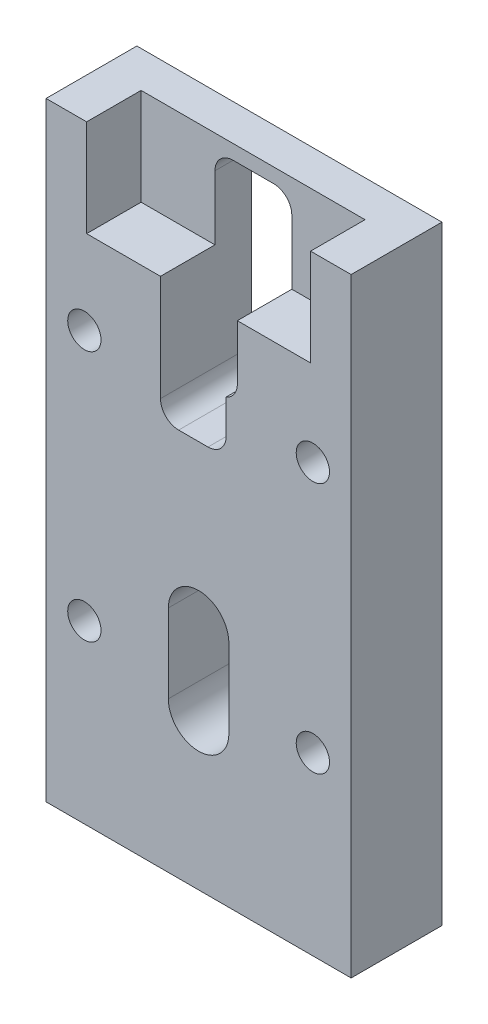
ISO-10303-21;
HEADER;
FILE_DESCRIPTION(('STEP AP214'),'2;1');
FILE_NAME('part.step','',(''),(''),'','','');
FILE_SCHEMA(('AUTOMOTIVE_DESIGN { 1 0 10303 214 1 1 1 1 }'));
ENDSEC;
DATA;
#1=APPLICATION_CONTEXT('core data for automotive mechanical design processes');
#2=APPLICATION_PROTOCOL_DEFINITION('international standard','automotive_design',2000,#1);
#3=PRODUCT_CONTEXT('',#1,'mechanical');
#4=PRODUCT('Part','Part','',(#3));
#5=PRODUCT_RELATED_PRODUCT_CATEGORY('part','',(#4));
#6=PRODUCT_DEFINITION_FORMATION('','',#4);
#7=PRODUCT_DEFINITION_CONTEXT('part definition',#1,'design');
#8=PRODUCT_DEFINITION('design','',#6,#7);
#9=PRODUCT_DEFINITION_SHAPE('','',#8);
#10=(LENGTH_UNIT() NAMED_UNIT(*) SI_UNIT(.MILLI.,.METRE.));
#11=(NAMED_UNIT(*) PLANE_ANGLE_UNIT() SI_UNIT($,.RADIAN.));
#12=(NAMED_UNIT(*) SI_UNIT($,.STERADIAN.) SOLID_ANGLE_UNIT());
#13=UNCERTAINTY_MEASURE_WITH_UNIT(LENGTH_MEASURE(1.E-05),#10,'distance_accuracy_value','');
#14=(GEOMETRIC_REPRESENTATION_CONTEXT(3) GLOBAL_UNCERTAINTY_ASSIGNED_CONTEXT((#13)) GLOBAL_UNIT_ASSIGNED_CONTEXT((#10,
#11,#12)) REPRESENTATION_CONTEXT('',''));
#15=CARTESIAN_POINT('',(0.,0.,0.));
#16=DIRECTION('',(0.,0.,1.));
#17=DIRECTION('',(1.,0.,0.));
#18=AXIS2_PLACEMENT_3D('',#15,#16,#17);
#19=CARTESIAN_POINT('',(18.5,34.325,-40.3112887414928));
#20=DIRECTION('',(0.,-1.,0.));
#21=DIRECTION('',(1.,0.,0.));
#22=AXIS2_PLACEMENT_3D('',#19,#20,#21);
#23=PLANE('',#22);
#24=DIRECTION('',(1.,0.,0.));
#25=VECTOR('',#24,1.);
#26=CARTESIAN_POINT('',(18.5,34.325,6.));
#27=LINE('',#26,#25);
#28=CARTESIAN_POINT('',(6.39999999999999,34.325,6.));
#29=VERTEX_POINT('',#28);
#30=CARTESIAN_POINT('',(18.5,34.325,6.));
#31=VERTEX_POINT('',#30);
#32=EDGE_CURVE('E296',#29,#31,#27,.T.);
#33=ORIENTED_EDGE('',*,*,#32,.F.);
#34=DIRECTION('',(0.,0.,1.));
#35=VECTOR('',#34,1.);
#36=CARTESIAN_POINT('',(6.39999999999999,34.325,-40.3112887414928));
#37=LINE('',#36,#35);
#38=CARTESIAN_POINT('',(6.39999999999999,34.325,15.));
#39=VERTEX_POINT('',#38);
#40=EDGE_CURVE('E342',#29,#39,#37,.T.);
#41=ORIENTED_EDGE('',*,*,#40,.T.);
#42=DIRECTION('',(1.,0.,0.));
#43=VECTOR('',#42,1.);
#44=CARTESIAN_POINT('',(18.5,34.325,15.));
#45=LINE('',#44,#43);
#46=CARTESIAN_POINT('',(18.5,34.325,15.));
#47=VERTEX_POINT('',#46);
#48=EDGE_CURVE('E281',#39,#47,#45,.T.);
#49=ORIENTED_EDGE('',*,*,#48,.T.);
#50=DIRECTION('',(0.,0.,1.));
#51=VECTOR('',#50,1.);
#52=CARTESIAN_POINT('',(18.5,34.325,-40.3112887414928));
#53=LINE('',#52,#51);
#54=EDGE_CURVE('E292',#31,#47,#53,.T.);
#55=ORIENTED_EDGE('',*,*,#54,.F.);
#56=EDGE_LOOP('',(#33,#41,#49,#55));
#57=FACE_BOUND('',#56,.T.);
#58=ADVANCED_FACE('F34',(#57),#23,.F.);
#59=CARTESIAN_POINT('',(25.2,-50.325,15.));
#60=DIRECTION('',(-1.,0.,0.));
#61=DIRECTION('',(0.,0.,1.));
#62=AXIS2_PLACEMENT_3D('',#59,#60,#61);
#63=PLANE('',#62);
#64=DIRECTION('',(0.,1.,0.));
#65=VECTOR('',#64,1.);
#66=CARTESIAN_POINT('',(25.2,-50.325,0.));
#67=LINE('',#66,#65);
#68=CARTESIAN_POINT('',(25.2,-50.325,0.));
#69=VERTEX_POINT('',#68);
#70=CARTESIAN_POINT('',(25.2,50.325,0.));
#71=VERTEX_POINT('',#70);
#72=EDGE_CURVE('E307',#69,#71,#67,.T.);
#73=ORIENTED_EDGE('',*,*,#72,.T.);
#74=DIRECTION('',(0.,0.,-1.));
#75=VECTOR('',#74,1.);
#76=CARTESIAN_POINT('',(25.2,50.325,15.));
#77=LINE('',#76,#75);
#78=CARTESIAN_POINT('',(25.2,50.325,15.));
#79=VERTEX_POINT('',#78);
#80=EDGE_CURVE('E336',#79,#71,#77,.T.);
#81=ORIENTED_EDGE('',*,*,#80,.F.);
#82=DIRECTION('',(0.,1.,0.));
#83=VECTOR('',#82,1.);
#84=CARTESIAN_POINT('',(25.2,-50.325,15.));
#85=LINE('',#84,#83);
#86=CARTESIAN_POINT('',(25.2,-50.325,15.));
#87=VERTEX_POINT('',#86);
#88=EDGE_CURVE('E308',#87,#79,#85,.T.);
#89=ORIENTED_EDGE('',*,*,#88,.F.);
#90=DIRECTION('',(0.,0.,-1.));
#91=VECTOR('',#90,1.);
#92=CARTESIAN_POINT('',(25.2,-50.325,15.));
#93=LINE('',#92,#91);
#94=EDGE_CURVE('E320',#87,#69,#93,.T.);
#95=ORIENTED_EDGE('',*,*,#94,.T.);
#96=EDGE_LOOP('',(#73,#81,#89,#95));
#97=FACE_BOUND('',#96,.T.);
#98=ADVANCED_FACE('F449',(#97),#63,.F.);
#99=CARTESIAN_POINT('',(-25.2,50.325,15.));
#100=DIRECTION('',(0.,-1.,0.));
#101=DIRECTION('',(0.,0.,-1.));
#102=AXIS2_PLACEMENT_3D('',#99,#100,#101);
#103=PLANE('',#102);
#104=DIRECTION('',(-1.,0.,0.));
#105=VECTOR('',#104,1.);
#106=CARTESIAN_POINT('',(-25.2,50.325,15.));
#107=LINE('',#106,#105);
#108=CARTESIAN_POINT('',(-18.5,50.325,15.));
#109=VERTEX_POINT('',#108);
#110=CARTESIAN_POINT('',(-25.2,50.325,15.));
#111=VERTEX_POINT('',#110);
#112=EDGE_CURVE('E311',#109,#111,#107,.T.);
#113=ORIENTED_EDGE('',*,*,#112,.F.);
#114=DIRECTION('',(0.,0.,1.));
#115=VECTOR('',#114,1.);
#116=CARTESIAN_POINT('',(-18.5,50.325,-40.3112887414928));
#117=LINE('',#116,#115);
#118=CARTESIAN_POINT('',(-18.5,50.325,5.99999999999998));
#119=VERTEX_POINT('',#118);
#120=EDGE_CURVE('E288',#119,#109,#117,.T.);
#121=ORIENTED_EDGE('',*,*,#120,.F.);
#122=DIRECTION('',(-1.,0.,0.));
#123=VECTOR('',#122,1.);
#124=CARTESIAN_POINT('',(18.5,50.325,6.));
#125=LINE('',#124,#123);
#126=CARTESIAN_POINT('',(18.5,50.325,6.));
#127=VERTEX_POINT('',#126);
#128=EDGE_CURVE('E280',#127,#119,#125,.T.);
#129=ORIENTED_EDGE('',*,*,#128,.F.);
#130=DIRECTION('',(0.,0.,1.));
#131=VECTOR('',#130,1.);
#132=CARTESIAN_POINT('',(18.5,50.325,-40.3112887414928));
#133=LINE('',#132,#131);
#134=CARTESIAN_POINT('',(18.5,50.325,15.));
#135=VERTEX_POINT('',#134);
#136=EDGE_CURVE('E291',#127,#135,#133,.T.);
#137=ORIENTED_EDGE('',*,*,#136,.T.);
#138=EDGE_CURVE('E313',#79,#135,#107,.T.);
#139=ORIENTED_EDGE('',*,*,#138,.F.);
#140=ORIENTED_EDGE('',*,*,#80,.T.);
#141=DIRECTION('',(-1.,0.,0.));
#142=VECTOR('',#141,1.);
#143=CARTESIAN_POINT('',(-25.2,50.325,0.));
#144=LINE('',#143,#142);
#145=CARTESIAN_POINT('',(-25.2,50.325,0.));
#146=VERTEX_POINT('',#145);
#147=EDGE_CURVE('E323',#71,#146,#144,.T.);
#148=ORIENTED_EDGE('',*,*,#147,.T.);
#149=DIRECTION('',(0.,0.,-1.));
#150=VECTOR('',#149,1.);
#151=CARTESIAN_POINT('',(-25.2,50.325,15.));
#152=LINE('',#151,#150);
#153=EDGE_CURVE('E333',#111,#146,#152,.T.);
#154=ORIENTED_EDGE('',*,*,#153,.F.);
#155=EDGE_LOOP('',(#113,#121,#129,#137,#139,#140,#148,#154));
#156=FACE_BOUND('',#155,.T.);
#157=ADVANCED_FACE('F462',(#156),#103,.F.);
#158=CARTESIAN_POINT('',(-25.2,-50.325,15.));
#159=DIRECTION('',(1.,0.,0.));
#160=DIRECTION('',(0.,0.,-1.));
#161=AXIS2_PLACEMENT_3D('',#158,#159,#160);
#162=PLANE('',#161);
#163=DIRECTION('',(0.,-1.,0.));
#164=VECTOR('',#163,1.);
#165=CARTESIAN_POINT('',(-25.2,-50.325,0.));
#166=LINE('',#165,#164);
#167=CARTESIAN_POINT('',(-25.2,-50.325,0.));
#168=VERTEX_POINT('',#167);
#169=EDGE_CURVE('E325',#146,#168,#166,.T.);
#170=ORIENTED_EDGE('',*,*,#169,.T.);
#171=DIRECTION('',(0.,0.,-1.));
#172=VECTOR('',#171,1.);
#173=CARTESIAN_POINT('',(-25.2,-50.325,15.));
#174=LINE('',#173,#172);
#175=CARTESIAN_POINT('',(-25.2,-50.325,15.));
#176=VERTEX_POINT('',#175);
#177=EDGE_CURVE('E330',#176,#168,#174,.T.);
#178=ORIENTED_EDGE('',*,*,#177,.F.);
#179=DIRECTION('',(0.,-1.,0.));
#180=VECTOR('',#179,1.);
#181=CARTESIAN_POINT('',(-25.2,-50.325,15.));
#182=LINE('',#181,#180);
#183=EDGE_CURVE('E316',#111,#176,#182,.T.);
#184=ORIENTED_EDGE('',*,*,#183,.F.);
#185=ORIENTED_EDGE('',*,*,#153,.T.);
#186=EDGE_LOOP('',(#170,#178,#184,#185));
#187=FACE_BOUND('',#186,.T.);
#188=ADVANCED_FACE('F458',(#187),#162,.F.);
#189=CARTESIAN_POINT('',(-25.2,-50.325,15.));
#190=DIRECTION('',(0.,1.,0.));
#191=DIRECTION('',(0.,0.,1.));
#192=AXIS2_PLACEMENT_3D('',#189,#190,#191);
#193=PLANE('',#192);
#194=DIRECTION('',(1.,0.,0.));
#195=VECTOR('',#194,1.);
#196=CARTESIAN_POINT('',(-25.2,-50.325,0.));
#197=LINE('',#196,#195);
#198=EDGE_CURVE('E312',#168,#69,#197,.T.);
#199=ORIENTED_EDGE('',*,*,#198,.T.);
#200=ORIENTED_EDGE('',*,*,#94,.F.);
#201=DIRECTION('',(1.,0.,0.));
#202=VECTOR('',#201,1.);
#203=CARTESIAN_POINT('',(-25.2,-50.325,15.));
#204=LINE('',#203,#202);
#205=EDGE_CURVE('E318',#176,#87,#204,.T.);
#206=ORIENTED_EDGE('',*,*,#205,.F.);
#207=ORIENTED_EDGE('',*,*,#177,.T.);
#208=EDGE_LOOP('',(#199,#200,#206,#207));
#209=FACE_BOUND('',#208,.T.);
#210=ADVANCED_FACE('F454',(#209),#193,.F.);
#211=CARTESIAN_POINT('',(0.,0.,15.));
#212=DIRECTION('',(0.,0.,-1.));
#213=DIRECTION('',(-1.,0.,0.));
#214=AXIS2_PLACEMENT_3D('',#211,#212,#213);
#215=PLANE('',#214);
#216=CARTESIAN_POINT('',(18.875,-21.25,15.));
#217=DIRECTION('',(0.,0.,-1.));
#218=DIRECTION('',(-1.,0.,0.));
#219=AXIS2_PLACEMENT_3D('',#216,#217,#218);
#220=CIRCLE('',#219,2.75);
#221=CARTESIAN_POINT('',(16.125,-21.25,15.));
#222=VERTEX_POINT('',#221);
#223=EDGE_CURVE('E769',#222,#222,#220,.T.);
#224=ORIENTED_EDGE('',*,*,#223,.T.);
#225=EDGE_LOOP('',(#224));
#226=FACE_BOUND('',#225,.T.);
#227=CARTESIAN_POINT('',(-18.875,-21.25,15.));
#228=DIRECTION('',(0.,0.,-1.));
#229=DIRECTION('',(-1.,0.,0.));
#230=AXIS2_PLACEMENT_3D('',#227,#228,#229);
#231=CIRCLE('',#230,2.75);
#232=CARTESIAN_POINT('',(-21.625,-21.25,15.));
#233=VERTEX_POINT('',#232);
#234=EDGE_CURVE('E765',#233,#233,#231,.T.);
#235=ORIENTED_EDGE('',*,*,#234,.T.);
#236=EDGE_LOOP('',(#235));
#237=FACE_BOUND('',#236,.T.);
#238=CARTESIAN_POINT('',(-18.875,20.3,15.));
#239=DIRECTION('',(0.,0.,-1.));
#240=DIRECTION('',(-1.,0.,0.));
#241=AXIS2_PLACEMENT_3D('',#238,#239,#240);
#242=CIRCLE('',#241,2.75);
#243=CARTESIAN_POINT('',(-21.625,20.3,15.));
#244=VERTEX_POINT('',#243);
#245=EDGE_CURVE('E763',#244,#244,#242,.T.);
#246=ORIENTED_EDGE('',*,*,#245,.T.);
#247=EDGE_LOOP('',(#246));
#248=FACE_BOUND('',#247,.T.);
#249=CARTESIAN_POINT('',(18.875,20.3,15.));
#250=DIRECTION('',(0.,0.,-1.));
#251=DIRECTION('',(-1.,0.,0.));
#252=AXIS2_PLACEMENT_3D('',#249,#250,#251);
#253=CIRCLE('',#252,2.75);
#254=CARTESIAN_POINT('',(16.125,20.3,15.));
#255=VERTEX_POINT('',#254);
#256=EDGE_CURVE('E390',#255,#255,#253,.T.);
#257=ORIENTED_EDGE('',*,*,#256,.T.);
#258=EDGE_LOOP('',(#257));
#259=FACE_BOUND('',#258,.T.);
#260=DIRECTION('',(0.,-1.,0.));
#261=VECTOR('',#260,1.);
#262=CARTESIAN_POINT('',(5.,-25.475,15.));
#263=LINE('',#262,#261);
#264=CARTESIAN_POINT('',(5.,-12.475,15.));
#265=VERTEX_POINT('',#264);
#266=CARTESIAN_POINT('',(5.,-25.475,15.));
#267=VERTEX_POINT('',#266);
#268=EDGE_CURVE('E209',#265,#267,#263,.T.);
#269=ORIENTED_EDGE('',*,*,#268,.T.);
#270=CARTESIAN_POINT('',(0.,-25.475,15.));
#271=DIRECTION('',(0.,0.,-1.));
#272=DIRECTION('',(-1.,0.,0.));
#273=AXIS2_PLACEMENT_3D('',#270,#271,#272);
#274=CIRCLE('',#273,5.);
#275=CARTESIAN_POINT('',(-5.,-25.475,15.));
#276=VERTEX_POINT('',#275);
#277=EDGE_CURVE('E201',#267,#276,#274,.T.);
#278=ORIENTED_EDGE('',*,*,#277,.T.);
#279=DIRECTION('',(0.,1.,0.));
#280=VECTOR('',#279,1.);
#281=CARTESIAN_POINT('',(-5.,-25.475,15.));
#282=LINE('',#281,#280);
#283=CARTESIAN_POINT('',(-5.,-12.475,15.));
#284=VERTEX_POINT('',#283);
#285=EDGE_CURVE('E213',#276,#284,#282,.T.);
#286=ORIENTED_EDGE('',*,*,#285,.T.);
#287=CARTESIAN_POINT('',(0.,-12.475,15.));
#288=DIRECTION('',(0.,0.,-1.));
#289=DIRECTION('',(-1.,0.,0.));
#290=AXIS2_PLACEMENT_3D('',#287,#288,#289);
#291=CIRCLE('',#290,5.);
#292=EDGE_CURVE('E217',#284,#265,#291,.T.);
#293=ORIENTED_EDGE('',*,*,#292,.T.);
#294=EDGE_LOOP('',(#269,#278,#286,#293));
#295=FACE_BOUND('',#294,.T.);
#296=ORIENTED_EDGE('',*,*,#48,.F.);
#297=DIRECTION('',(0.,-1.,0.));
#298=VECTOR('',#297,1.);
#299=CARTESIAN_POINT('',(6.39999999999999,47.925,15.));
#300=LINE('',#299,#298);
#301=CARTESIAN_POINT('',(6.39999999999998,25.2458302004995,15.));
#302=VERTEX_POINT('',#301);
#303=EDGE_CURVE('E251',#39,#302,#300,.T.);
#304=ORIENTED_EDGE('',*,*,#303,.T.);
#305=CARTESIAN_POINT('',(3.39999999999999,25.2458302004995,15.));
#306=DIRECTION('',(0.,0.,-1.));
#307=DIRECTION('',(-1.,0.,0.));
#308=AXIS2_PLACEMENT_3D('',#305,#306,#307);
#309=CIRCLE('',#308,3.);
#310=CARTESIAN_POINT('',(4.54999999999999,22.475,15.));
#311=VERTEX_POINT('',#310);
#312=EDGE_CURVE('E383',#302,#311,#309,.T.);
#313=ORIENTED_EDGE('',*,*,#312,.T.);
#314=DIRECTION('',(0.,-1.,0.));
#315=VECTOR('',#314,1.);
#316=CARTESIAN_POINT('',(4.54999999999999,22.475,15.));
#317=LINE('',#316,#315);
#318=CARTESIAN_POINT('',(4.54999999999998,16.825,15.));
#319=VERTEX_POINT('',#318);
#320=EDGE_CURVE('E254',#311,#319,#317,.T.);
#321=ORIENTED_EDGE('',*,*,#320,.T.);
#322=CARTESIAN_POINT('',(1.54999999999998,16.825,15.));
#323=DIRECTION('',(0.,0.,-1.));
#324=DIRECTION('',(-1.,0.,0.));
#325=AXIS2_PLACEMENT_3D('',#322,#323,#324);
#326=CIRCLE('',#325,3.);
#327=CARTESIAN_POINT('',(1.54999999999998,13.825,15.));
#328=VERTEX_POINT('',#327);
#329=EDGE_CURVE('E12',#319,#328,#326,.T.);
#330=ORIENTED_EDGE('',*,*,#329,.T.);
#331=DIRECTION('',(-1.,0.,0.));
#332=VECTOR('',#331,1.);
#333=CARTESIAN_POINT('',(4.54999999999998,13.825,15.));
#334=LINE('',#333,#332);
#335=CARTESIAN_POINT('',(-3.30000000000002,13.825,15.));
#336=VERTEX_POINT('',#335);
#337=EDGE_CURVE('E245',#328,#336,#334,.T.);
#338=ORIENTED_EDGE('',*,*,#337,.T.);
#339=CARTESIAN_POINT('',(-3.30000000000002,16.825,15.));
#340=DIRECTION('',(0.,0.,-1.));
#341=DIRECTION('',(-1.,0.,0.));
#342=AXIS2_PLACEMENT_3D('',#339,#340,#341);
#343=CIRCLE('',#342,3.);
#344=CARTESIAN_POINT('',(-6.30000000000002,16.825,15.));
#345=VERTEX_POINT('',#344);
#346=EDGE_CURVE('E371',#336,#345,#343,.T.);
#347=ORIENTED_EDGE('',*,*,#346,.T.);
#348=DIRECTION('',(0.,1.,0.));
#349=VECTOR('',#348,1.);
#350=CARTESIAN_POINT('',(-6.30000000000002,13.825,15.));
#351=LINE('',#350,#349);
#352=CARTESIAN_POINT('',(-6.30000000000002,34.325,15.));
#353=VERTEX_POINT('',#352);
#354=EDGE_CURVE('E248',#345,#353,#351,.T.);
#355=ORIENTED_EDGE('',*,*,#354,.T.);
#356=CARTESIAN_POINT('',(-18.5,34.325,15.));
#357=VERTEX_POINT('',#356);
#358=EDGE_CURVE('E277',#357,#353,#45,.T.);
#359=ORIENTED_EDGE('',*,*,#358,.F.);
#360=DIRECTION('',(0.,-1.,0.));
#361=VECTOR('',#360,1.);
#362=CARTESIAN_POINT('',(-18.5,50.325,15.));
#363=LINE('',#362,#361);
#364=EDGE_CURVE('E282',#109,#357,#363,.T.);
#365=ORIENTED_EDGE('',*,*,#364,.F.);
#366=ORIENTED_EDGE('',*,*,#112,.T.);
#367=ORIENTED_EDGE('',*,*,#183,.T.);
#368=ORIENTED_EDGE('',*,*,#205,.T.);
#369=ORIENTED_EDGE('',*,*,#88,.T.);
#370=ORIENTED_EDGE('',*,*,#138,.T.);
#371=DIRECTION('',(0.,1.,0.));
#372=VECTOR('',#371,1.);
#373=CARTESIAN_POINT('',(18.5,50.325,15.));
#374=LINE('',#373,#372);
#375=EDGE_CURVE('E276',#47,#135,#374,.T.);
#376=ORIENTED_EDGE('',*,*,#375,.F.);
#377=EDGE_LOOP('',(#296,#304,#313,#321,#330,#338,#347,#355,#359,#365,#366,#367,#368,#369,#370,#376));
#378=FACE_BOUND('',#377,.T.);
#379=ADVANCED_FACE('F219',(#226,#237,#248,#259,#295,#378),#215,.F.);
#380=CARTESIAN_POINT('',(0.,0.,0.));
#381=DIRECTION('',(0.,0.,-1.));
#382=DIRECTION('',(-1.,0.,0.));
#383=AXIS2_PLACEMENT_3D('',#380,#381,#382);
#384=PLANE('',#383);
#385=CARTESIAN_POINT('',(18.875,20.3,0.));
#386=DIRECTION('',(0.,0.,-1.));
#387=DIRECTION('',(-1.,0.,0.));
#388=AXIS2_PLACEMENT_3D('',#385,#386,#387);
#389=CIRCLE('',#388,4.725);
#390=CARTESIAN_POINT('',(14.15,20.3,0.));
#391=VERTEX_POINT('',#390);
#392=EDGE_CURVE('E397',#391,#391,#389,.T.);
#393=ORIENTED_EDGE('',*,*,#392,.F.);
#394=EDGE_LOOP('',(#393));
#395=FACE_BOUND('',#394,.T.);
#396=CARTESIAN_POINT('',(18.875,-21.25,0.));
#397=DIRECTION('',(0.,0.,-1.));
#398=DIRECTION('',(-1.,0.,0.));
#399=AXIS2_PLACEMENT_3D('',#396,#397,#398);
#400=CIRCLE('',#399,4.725);
#401=CARTESIAN_POINT('',(14.15,-21.25,0.));
#402=VERTEX_POINT('',#401);
#403=EDGE_CURVE('E406',#402,#402,#400,.T.);
#404=ORIENTED_EDGE('',*,*,#403,.F.);
#405=EDGE_LOOP('',(#404));
#406=FACE_BOUND('',#405,.T.);
#407=CARTESIAN_POINT('',(-18.875,-21.25,0.));
#408=DIRECTION('',(0.,0.,-1.));
#409=DIRECTION('',(-1.,0.,0.));
#410=AXIS2_PLACEMENT_3D('',#407,#408,#409);
#411=CIRCLE('',#410,4.725);
#412=CARTESIAN_POINT('',(-23.6,-21.25,0.));
#413=VERTEX_POINT('',#412);
#414=EDGE_CURVE('E417',#413,#413,#411,.T.);
#415=ORIENTED_EDGE('',*,*,#414,.F.);
#416=EDGE_LOOP('',(#415));
#417=FACE_BOUND('',#416,.T.);
#418=CARTESIAN_POINT('',(-18.875,20.3,0.));
#419=DIRECTION('',(0.,0.,-1.));
#420=DIRECTION('',(-1.,0.,0.));
#421=AXIS2_PLACEMENT_3D('',#418,#419,#420);
#422=CIRCLE('',#421,4.725);
#423=CARTESIAN_POINT('',(-23.6,20.3,0.));
#424=VERTEX_POINT('',#423);
#425=EDGE_CURVE('E228',#424,#424,#422,.T.);
#426=ORIENTED_EDGE('',*,*,#425,.F.);
#427=EDGE_LOOP('',(#426));
#428=FACE_BOUND('',#427,.T.);
#429=CARTESIAN_POINT('',(0.,-25.475,0.));
#430=DIRECTION('',(0.,0.,-1.));
#431=DIRECTION('',(-1.,0.,0.));
#432=AXIS2_PLACEMENT_3D('',#429,#430,#431);
#433=CIRCLE('',#432,5.);
#434=CARTESIAN_POINT('',(5.,-25.475,0.));
#435=VERTEX_POINT('',#434);
#436=CARTESIAN_POINT('',(-5.,-25.475,0.));
#437=VERTEX_POINT('',#436);
#438=EDGE_CURVE('E204',#435,#437,#433,.T.);
#439=ORIENTED_EDGE('',*,*,#438,.F.);
#440=DIRECTION('',(0.,-1.,0.));
#441=VECTOR('',#440,1.);
#442=CARTESIAN_POINT('',(5.,-25.475,0.));
#443=LINE('',#442,#441);
#444=CARTESIAN_POINT('',(5.,-12.475,0.));
#445=VERTEX_POINT('',#444);
#446=EDGE_CURVE('E222',#445,#435,#443,.T.);
#447=ORIENTED_EDGE('',*,*,#446,.F.);
#448=CARTESIAN_POINT('',(0.,-12.475,0.));
#449=DIRECTION('',(0.,0.,-1.));
#450=DIRECTION('',(-1.,0.,0.));
#451=AXIS2_PLACEMENT_3D('',#448,#449,#450);
#452=CIRCLE('',#451,5.);
#453=CARTESIAN_POINT('',(-5.,-12.475,0.));
#454=VERTEX_POINT('',#453);
#455=EDGE_CURVE('E225',#454,#445,#452,.T.);
#456=ORIENTED_EDGE('',*,*,#455,.F.);
#457=DIRECTION('',(0.,1.,0.));
#458=VECTOR('',#457,1.);
#459=CARTESIAN_POINT('',(-5.,-25.475,0.));
#460=LINE('',#459,#458);
#461=EDGE_CURVE('E234',#437,#454,#460,.T.);
#462=ORIENTED_EDGE('',*,*,#461,.F.);
#463=EDGE_LOOP('',(#439,#447,#456,#462));
#464=FACE_BOUND('',#463,.T.);
#465=DIRECTION('',(-1.,0.,0.));
#466=VECTOR('',#465,1.);
#467=CARTESIAN_POINT('',(4.54999999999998,13.825,0.));
#468=LINE('',#467,#466);
#469=CARTESIAN_POINT('',(1.54999999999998,13.825,0.));
#470=VERTEX_POINT('',#469);
#471=CARTESIAN_POINT('',(-3.30000000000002,13.825,0.));
#472=VERTEX_POINT('',#471);
#473=EDGE_CURVE('E256',#470,#472,#468,.T.);
#474=ORIENTED_EDGE('',*,*,#473,.F.);
#475=CARTESIAN_POINT('',(1.54999999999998,16.825,0.));
#476=DIRECTION('',(0.,0.,-1.));
#477=DIRECTION('',(-1.,0.,0.));
#478=AXIS2_PLACEMENT_3D('',#475,#476,#477);
#479=CIRCLE('',#478,3.);
#480=CARTESIAN_POINT('',(4.54999999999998,16.825,0.));
#481=VERTEX_POINT('',#480);
#482=EDGE_CURVE('E43',#470,#481,#479,.F.);
#483=ORIENTED_EDGE('',*,*,#482,.T.);
#484=DIRECTION('',(0.,-1.,0.));
#485=VECTOR('',#484,1.);
#486=CARTESIAN_POINT('',(4.54999999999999,22.475,0.));
#487=LINE('',#486,#485);
#488=CARTESIAN_POINT('',(4.54999999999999,22.475,0.));
#489=VERTEX_POINT('',#488);
#490=EDGE_CURVE('E249',#489,#481,#487,.T.);
#491=ORIENTED_EDGE('',*,*,#490,.F.);
#492=CARTESIAN_POINT('',(3.39999999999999,25.2458302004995,0.));
#493=DIRECTION('',(0.,0.,-1.));
#494=DIRECTION('',(-1.,0.,0.));
#495=AXIS2_PLACEMENT_3D('',#492,#493,#494);
#496=CIRCLE('',#495,3.);
#497=CARTESIAN_POINT('',(6.39999999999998,25.2458302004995,0.));
#498=VERTEX_POINT('',#497);
#499=EDGE_CURVE('E381',#489,#498,#496,.F.);
#500=ORIENTED_EDGE('',*,*,#499,.T.);
#501=DIRECTION('',(0.,-1.,0.));
#502=VECTOR('',#501,1.);
#503=CARTESIAN_POINT('',(6.39999999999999,47.925,0.));
#504=LINE('',#503,#502);
#505=CARTESIAN_POINT('',(6.39999999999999,44.925,0.));
#506=VERTEX_POINT('',#505);
#507=EDGE_CURVE('E266',#506,#498,#504,.T.);
#508=ORIENTED_EDGE('',*,*,#507,.F.);
#509=CARTESIAN_POINT('',(3.39999999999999,44.925,0.));
#510=DIRECTION('',(0.,0.,-1.));
#511=DIRECTION('',(-1.,0.,0.));
#512=AXIS2_PLACEMENT_3D('',#509,#510,#511);
#513=CIRCLE('',#512,3.);
#514=CARTESIAN_POINT('',(3.39999999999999,47.925,0.));
#515=VERTEX_POINT('',#514);
#516=EDGE_CURVE('E377',#506,#515,#513,.F.);
#517=ORIENTED_EDGE('',*,*,#516,.T.);
#518=DIRECTION('',(1.,0.,0.));
#519=VECTOR('',#518,1.);
#520=CARTESIAN_POINT('',(-6.30000000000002,47.925,0.));
#521=LINE('',#520,#519);
#522=CARTESIAN_POINT('',(-3.30000000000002,47.925,0.));
#523=VERTEX_POINT('',#522);
#524=EDGE_CURVE('E263',#523,#515,#521,.T.);
#525=ORIENTED_EDGE('',*,*,#524,.F.);
#526=CARTESIAN_POINT('',(-3.30000000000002,44.925,0.));
#527=DIRECTION('',(0.,0.,-1.));
#528=DIRECTION('',(-1.,0.,0.));
#529=AXIS2_PLACEMENT_3D('',#526,#527,#528);
#530=CIRCLE('',#529,3.);
#531=CARTESIAN_POINT('',(-6.30000000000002,44.925,0.));
#532=VERTEX_POINT('',#531);
#533=EDGE_CURVE('E373',#523,#532,#530,.F.);
#534=ORIENTED_EDGE('',*,*,#533,.T.);
#535=DIRECTION('',(0.,1.,0.));
#536=VECTOR('',#535,1.);
#537=CARTESIAN_POINT('',(-6.30000000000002,13.825,0.));
#538=LINE('',#537,#536);
#539=CARTESIAN_POINT('',(-6.30000000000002,16.825,0.));
#540=VERTEX_POINT('',#539);
#541=EDGE_CURVE('E259',#540,#532,#538,.T.);
#542=ORIENTED_EDGE('',*,*,#541,.F.);
#543=CARTESIAN_POINT('',(-3.30000000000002,16.825,0.));
#544=DIRECTION('',(0.,0.,-1.));
#545=DIRECTION('',(-1.,0.,0.));
#546=AXIS2_PLACEMENT_3D('',#543,#544,#545);
#547=CIRCLE('',#546,3.);
#548=EDGE_CURVE('E369',#540,#472,#547,.F.);
#549=ORIENTED_EDGE('',*,*,#548,.T.);
#550=EDGE_LOOP('',(#474,#483,#491,#500,#508,#517,#525,#534,#542,#549));
#551=FACE_BOUND('',#550,.T.);
#552=ORIENTED_EDGE('',*,*,#72,.F.);
#553=ORIENTED_EDGE('',*,*,#198,.F.);
#554=ORIENTED_EDGE('',*,*,#169,.F.);
#555=ORIENTED_EDGE('',*,*,#147,.F.);
#556=EDGE_LOOP('',(#552,#553,#554,#555));
#557=FACE_BOUND('',#556,.T.);
#558=ADVANCED_FACE('F433',(#395,#406,#417,#428,#464,#551,#557),#384,.T.);
#559=CARTESIAN_POINT('',(0.,0.,6.));
#560=DIRECTION('',(0.,0.,-1.));
#561=DIRECTION('',(-1.,0.,0.));
#562=AXIS2_PLACEMENT_3D('',#559,#560,#561);
#563=PLANE('',#562);
#564=DIRECTION('',(0.,1.,0.));
#565=VECTOR('',#564,1.);
#566=CARTESIAN_POINT('',(-6.30000000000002,0.,6.));
#567=LINE('',#566,#565);
#568=CARTESIAN_POINT('',(-6.30000000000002,34.325,6.));
#569=VERTEX_POINT('',#568);
#570=CARTESIAN_POINT('',(-6.30000000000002,44.925,6.));
#571=VERTEX_POINT('',#570);
#572=EDGE_CURVE('E241',#569,#571,#567,.T.);
#573=ORIENTED_EDGE('',*,*,#572,.T.);
#574=CARTESIAN_POINT('',(-3.30000000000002,44.925,6.));
#575=DIRECTION('',(0.,0.,-1.));
#576=DIRECTION('',(-1.,0.,0.));
#577=AXIS2_PLACEMENT_3D('',#574,#575,#576);
#578=CIRCLE('',#577,3.);
#579=CARTESIAN_POINT('',(-3.30000000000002,47.925,6.));
#580=VERTEX_POINT('',#579);
#581=EDGE_CURVE('E375',#571,#580,#578,.T.);
#582=ORIENTED_EDGE('',*,*,#581,.T.);
#583=DIRECTION('',(1.,0.,0.));
#584=VECTOR('',#583,1.);
#585=CARTESIAN_POINT('',(0.,47.925,6.));
#586=LINE('',#585,#584);
#587=CARTESIAN_POINT('',(3.39999999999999,47.925,6.));
#588=VERTEX_POINT('',#587);
#589=EDGE_CURVE('E345',#580,#588,#586,.T.);
#590=ORIENTED_EDGE('',*,*,#589,.T.);
#591=CARTESIAN_POINT('',(3.39999999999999,44.925,6.));
#592=DIRECTION('',(0.,0.,-1.));
#593=DIRECTION('',(-1.,0.,0.));
#594=AXIS2_PLACEMENT_3D('',#591,#592,#593);
#595=CIRCLE('',#594,3.);
#596=CARTESIAN_POINT('',(6.39999999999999,44.925,6.));
#597=VERTEX_POINT('',#596);
#598=EDGE_CURVE('E379',#588,#597,#595,.T.);
#599=ORIENTED_EDGE('',*,*,#598,.T.);
#600=DIRECTION('',(0.,-1.,0.));
#601=VECTOR('',#600,1.);
#602=CARTESIAN_POINT('',(6.39999999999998,0.,6.));
#603=LINE('',#602,#601);
#604=EDGE_CURVE('E274',#597,#29,#603,.T.);
#605=ORIENTED_EDGE('',*,*,#604,.T.);
#606=ORIENTED_EDGE('',*,*,#32,.T.);
#607=DIRECTION('',(0.,1.,0.));
#608=VECTOR('',#607,1.);
#609=CARTESIAN_POINT('',(18.5,50.325,6.));
#610=LINE('',#609,#608);
#611=EDGE_CURVE('E289',#31,#127,#610,.T.);
#612=ORIENTED_EDGE('',*,*,#611,.T.);
#613=ORIENTED_EDGE('',*,*,#128,.T.);
#614=DIRECTION('',(0.,-1.,0.));
#615=VECTOR('',#614,1.);
#616=CARTESIAN_POINT('',(-18.5,50.325,6.));
#617=LINE('',#616,#615);
#618=CARTESIAN_POINT('',(-18.5,34.325,6.));
#619=VERTEX_POINT('',#618);
#620=EDGE_CURVE('E297',#119,#619,#617,.T.);
#621=ORIENTED_EDGE('',*,*,#620,.T.);
#622=EDGE_CURVE('E293',#619,#569,#27,.T.);
#623=ORIENTED_EDGE('',*,*,#622,.T.);
#624=EDGE_LOOP('',(#573,#582,#590,#599,#605,#606,#612,#613,#621,#623));
#625=FACE_BOUND('',#624,.T.);
#626=ADVANCED_FACE('F436',(#625),#563,.F.);
#627=CARTESIAN_POINT('',(-18.5,50.325,-40.3112887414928));
#628=DIRECTION('',(-1.,0.,0.));
#629=DIRECTION('',(0.,0.,1.));
#630=AXIS2_PLACEMENT_3D('',#627,#628,#629);
#631=PLANE('',#630);
#632=ORIENTED_EDGE('',*,*,#120,.T.);
#633=ORIENTED_EDGE('',*,*,#364,.T.);
#634=DIRECTION('',(0.,0.,1.));
#635=VECTOR('',#634,1.);
#636=CARTESIAN_POINT('',(-18.5,34.325,-40.3112887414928));
#637=LINE('',#636,#635);
#638=EDGE_CURVE('E300',#619,#357,#637,.T.);
#639=ORIENTED_EDGE('',*,*,#638,.F.);
#640=ORIENTED_EDGE('',*,*,#620,.F.);
#641=EDGE_LOOP('',(#632,#633,#639,#640));
#642=FACE_BOUND('',#641,.T.);
#643=ADVANCED_FACE('F472',(#642),#631,.F.);
#644=ORIENTED_EDGE('',*,*,#358,.T.);
#645=DIRECTION('',(0.,0.,-1.));
#646=VECTOR('',#645,1.);
#647=CARTESIAN_POINT('',(-6.30000000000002,34.325,-40.3112887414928));
#648=LINE('',#647,#646);
#649=EDGE_CURVE('E339',#353,#569,#648,.T.);
#650=ORIENTED_EDGE('',*,*,#649,.T.);
#651=ORIENTED_EDGE('',*,*,#622,.F.);
#652=ORIENTED_EDGE('',*,*,#638,.T.);
#653=EDGE_LOOP('',(#644,#650,#651,#652));
#654=FACE_BOUND('',#653,.T.);
#655=ADVANCED_FACE('F522',(#654),#23,.F.);
#656=CARTESIAN_POINT('',(18.5,50.325,-40.3112887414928));
#657=DIRECTION('',(1.,0.,0.));
#658=DIRECTION('',(0.,0.,-1.));
#659=AXIS2_PLACEMENT_3D('',#656,#657,#658);
#660=PLANE('',#659);
#661=ORIENTED_EDGE('',*,*,#54,.T.);
#662=ORIENTED_EDGE('',*,*,#375,.T.);
#663=ORIENTED_EDGE('',*,*,#136,.F.);
#664=ORIENTED_EDGE('',*,*,#611,.F.);
#665=EDGE_LOOP('',(#661,#662,#663,#664));
#666=FACE_BOUND('',#665,.T.);
#667=ADVANCED_FACE('F478',(#666),#660,.F.);
#668=CARTESIAN_POINT('',(-6.30000000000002,47.925,15.));
#669=DIRECTION('',(0.,1.,0.));
#670=DIRECTION('',(0.,0.,1.));
#671=AXIS2_PLACEMENT_3D('',#668,#669,#670);
#672=PLANE('',#671);
#673=ORIENTED_EDGE('',*,*,#589,.F.);
#674=DIRECTION('',(0.,0.,-1.));
#675=VECTOR('',#674,1.);
#676=CARTESIAN_POINT('',(-3.30000000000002,47.925,0.));
#677=LINE('',#676,#675);
#678=EDGE_CURVE('E360',#580,#523,#677,.T.);
#679=ORIENTED_EDGE('',*,*,#678,.T.);
#680=ORIENTED_EDGE('',*,*,#524,.T.);
#681=DIRECTION('',(0.,0.,-1.));
#682=VECTOR('',#681,1.);
#683=CARTESIAN_POINT('',(3.39999999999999,47.925,6.));
#684=LINE('',#683,#682);
#685=EDGE_CURVE('E358',#515,#588,#684,.F.);
#686=ORIENTED_EDGE('',*,*,#685,.T.);
#687=EDGE_LOOP('',(#673,#679,#680,#686));
#688=FACE_BOUND('',#687,.T.);
#689=ADVANCED_FACE('F498',(#688),#672,.F.);
#690=CARTESIAN_POINT('',(6.39999999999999,47.925,15.));
#691=DIRECTION('',(1.,0.,0.));
#692=DIRECTION('',(0.,1.,0.));
#693=AXIS2_PLACEMENT_3D('',#690,#691,#692);
#694=PLANE('',#693);
#695=ORIENTED_EDGE('',*,*,#604,.F.);
#696=DIRECTION('',(0.,0.,-1.));
#697=VECTOR('',#696,1.);
#698=CARTESIAN_POINT('',(6.39999999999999,44.925,0.));
#699=LINE('',#698,#697);
#700=EDGE_CURVE('E365',#597,#506,#699,.T.);
#701=ORIENTED_EDGE('',*,*,#700,.T.);
#702=ORIENTED_EDGE('',*,*,#507,.T.);
#703=DIRECTION('',(0.,0.,1.));
#704=VECTOR('',#703,1.);
#705=CARTESIAN_POINT('',(6.39999999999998,25.2458302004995,15.));
#706=LINE('',#705,#704);
#707=EDGE_CURVE('E363',#498,#302,#706,.T.);
#708=ORIENTED_EDGE('',*,*,#707,.T.);
#709=ORIENTED_EDGE('',*,*,#303,.F.);
#710=ORIENTED_EDGE('',*,*,#40,.F.);
#711=EDGE_LOOP('',(#695,#701,#702,#708,#709,#710));
#712=FACE_BOUND('',#711,.T.);
#713=ADVANCED_FACE('F484',(#712),#694,.F.);
#714=CARTESIAN_POINT('',(-6.30000000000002,13.825,15.));
#715=DIRECTION('',(-1.,0.,0.));
#716=DIRECTION('',(0.,0.,1.));
#717=AXIS2_PLACEMENT_3D('',#714,#715,#716);
#718=PLANE('',#717);
#719=ORIENTED_EDGE('',*,*,#354,.F.);
#720=DIRECTION('',(0.,0.,-1.));
#721=VECTOR('',#720,1.);
#722=CARTESIAN_POINT('',(-6.30000000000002,16.825,0.));
#723=LINE('',#722,#721);
#724=EDGE_CURVE('E350',#345,#540,#723,.T.);
#725=ORIENTED_EDGE('',*,*,#724,.T.);
#726=ORIENTED_EDGE('',*,*,#541,.T.);
#727=DIRECTION('',(0.,0.,-1.));
#728=VECTOR('',#727,1.);
#729=CARTESIAN_POINT('',(-6.30000000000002,44.925,6.));
#730=LINE('',#729,#728);
#731=EDGE_CURVE('E348',#532,#571,#730,.F.);
#732=ORIENTED_EDGE('',*,*,#731,.T.);
#733=ORIENTED_EDGE('',*,*,#572,.F.);
#734=ORIENTED_EDGE('',*,*,#649,.F.);
#735=EDGE_LOOP('',(#719,#725,#726,#732,#733,#734));
#736=FACE_BOUND('',#735,.T.);
#737=ADVANCED_FACE('F509',(#736),#718,.F.);
#738=CARTESIAN_POINT('',(4.54999999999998,13.825,15.));
#739=DIRECTION('',(0.,-1.,0.));
#740=DIRECTION('',(0.,0.,-1.));
#741=AXIS2_PLACEMENT_3D('',#738,#739,#740);
#742=PLANE('',#741);
#743=ORIENTED_EDGE('',*,*,#473,.T.);
#744=DIRECTION('',(0.,0.,-1.));
#745=VECTOR('',#744,1.);
#746=CARTESIAN_POINT('',(-3.30000000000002,13.825,15.));
#747=LINE('',#746,#745);
#748=EDGE_CURVE('E356',#472,#336,#747,.F.);
#749=ORIENTED_EDGE('',*,*,#748,.T.);
#750=ORIENTED_EDGE('',*,*,#337,.F.);
#751=DIRECTION('',(0.,0.,-1.));
#752=VECTOR('',#751,1.);
#753=CARTESIAN_POINT('',(1.54999999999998,13.825,0.));
#754=LINE('',#753,#752);
#755=EDGE_CURVE('E353',#328,#470,#754,.T.);
#756=ORIENTED_EDGE('',*,*,#755,.T.);
#757=EDGE_LOOP('',(#743,#749,#750,#756));
#758=FACE_BOUND('',#757,.T.);
#759=ADVANCED_FACE('F517',(#758),#742,.F.);
#760=CARTESIAN_POINT('',(4.54999999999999,22.475,15.));
#761=DIRECTION('',(1.,0.,0.));
#762=DIRECTION('',(0.,1.,0.));
#763=AXIS2_PLACEMENT_3D('',#760,#761,#762);
#764=PLANE('',#763);
#765=ORIENTED_EDGE('',*,*,#490,.T.);
#766=DIRECTION('',(0.,0.,-1.));
#767=VECTOR('',#766,1.);
#768=CARTESIAN_POINT('',(4.54999999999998,16.825,15.));
#769=LINE('',#768,#767);
#770=EDGE_CURVE('E51',#481,#319,#769,.F.);
#771=ORIENTED_EDGE('',*,*,#770,.T.);
#772=ORIENTED_EDGE('',*,*,#320,.F.);
#773=DIRECTION('',(0.,0.,-1.));
#774=VECTOR('',#773,1.);
#775=CARTESIAN_POINT('',(4.54999999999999,22.475,15.));
#776=LINE('',#775,#774);
#777=EDGE_CURVE('E235',#311,#489,#776,.T.);
#778=ORIENTED_EDGE('',*,*,#777,.T.);
#779=EDGE_LOOP('',(#765,#771,#772,#778));
#780=FACE_BOUND('',#779,.T.);
#781=ADVANCED_FACE('F492',(#780),#764,.F.);
#782=CARTESIAN_POINT('',(0.,-25.475,15.));
#783=DIRECTION('',(0.,0.,-1.));
#784=DIRECTION('',(-1.,0.,0.));
#785=AXIS2_PLACEMENT_3D('',#782,#783,#784);
#786=CYLINDRICAL_SURFACE('',#785,5.);
#787=ORIENTED_EDGE('',*,*,#438,.T.);
#788=DIRECTION('',(0.,0.,-1.));
#789=VECTOR('',#788,1.);
#790=CARTESIAN_POINT('',(-5.,-25.475,15.));
#791=LINE('',#790,#789);
#792=EDGE_CURVE('E197',#276,#437,#791,.T.);
#793=ORIENTED_EDGE('',*,*,#792,.F.);
#794=ORIENTED_EDGE('',*,*,#277,.F.);
#795=DIRECTION('',(0.,0.,-1.));
#796=VECTOR('',#795,1.);
#797=CARTESIAN_POINT('',(5.,-25.475,15.));
#798=LINE('',#797,#796);
#799=EDGE_CURVE('E239',#267,#435,#798,.T.);
#800=ORIENTED_EDGE('',*,*,#799,.T.);
#801=EDGE_LOOP('',(#787,#793,#794,#800));
#802=FACE_BOUND('',#801,.T.);
#803=ADVANCED_FACE('F199',(#802),#786,.F.);
#804=CARTESIAN_POINT('',(5.,-25.475,15.));
#805=DIRECTION('',(1.,0.,0.));
#806=DIRECTION('',(0.,0.,-1.));
#807=AXIS2_PLACEMENT_3D('',#804,#805,#806);
#808=PLANE('',#807);
#809=ORIENTED_EDGE('',*,*,#446,.T.);
#810=ORIENTED_EDGE('',*,*,#799,.F.);
#811=ORIENTED_EDGE('',*,*,#268,.F.);
#812=DIRECTION('',(0.,0.,-1.));
#813=VECTOR('',#812,1.);
#814=CARTESIAN_POINT('',(5.,-12.475,15.));
#815=LINE('',#814,#813);
#816=EDGE_CURVE('E242',#265,#445,#815,.T.);
#817=ORIENTED_EDGE('',*,*,#816,.T.);
#818=EDGE_LOOP('',(#809,#810,#811,#817));
#819=FACE_BOUND('',#818,.T.);
#820=ADVANCED_FACE('F566',(#819),#808,.F.);
#821=CARTESIAN_POINT('',(0.,-12.475,15.));
#822=DIRECTION('',(0.,0.,-1.));
#823=DIRECTION('',(-1.,0.,0.));
#824=AXIS2_PLACEMENT_3D('',#821,#822,#823);
#825=CYLINDRICAL_SURFACE('',#824,5.);
#826=ORIENTED_EDGE('',*,*,#455,.T.);
#827=ORIENTED_EDGE('',*,*,#816,.F.);
#828=ORIENTED_EDGE('',*,*,#292,.F.);
#829=DIRECTION('',(0.,0.,-1.));
#830=VECTOR('',#829,1.);
#831=CARTESIAN_POINT('',(-5.,-12.475,15.));
#832=LINE('',#831,#830);
#833=EDGE_CURVE('E208',#284,#454,#832,.T.);
#834=ORIENTED_EDGE('',*,*,#833,.T.);
#835=EDGE_LOOP('',(#826,#827,#828,#834));
#836=FACE_BOUND('',#835,.T.);
#837=ADVANCED_FACE('F569',(#836),#825,.F.);
#838=CARTESIAN_POINT('',(-5.,-25.475,15.));
#839=DIRECTION('',(-1.,0.,0.));
#840=DIRECTION('',(0.,0.,1.));
#841=AXIS2_PLACEMENT_3D('',#838,#839,#840);
#842=PLANE('',#841);
#843=ORIENTED_EDGE('',*,*,#461,.T.);
#844=ORIENTED_EDGE('',*,*,#833,.F.);
#845=ORIENTED_EDGE('',*,*,#285,.F.);
#846=ORIENTED_EDGE('',*,*,#792,.T.);
#847=EDGE_LOOP('',(#843,#844,#845,#846));
#848=FACE_BOUND('',#847,.T.);
#849=ADVANCED_FACE('F214',(#848),#842,.F.);
#850=CARTESIAN_POINT('',(-3.30000000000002,16.825,15.));
#851=DIRECTION('',(0.,0.,1.));
#852=DIRECTION('',(1.,0.,0.));
#853=AXIS2_PLACEMENT_3D('',#850,#851,#852);
#854=CYLINDRICAL_SURFACE('',#853,3.);
#855=ORIENTED_EDGE('',*,*,#346,.F.);
#856=ORIENTED_EDGE('',*,*,#748,.F.);
#857=ORIENTED_EDGE('',*,*,#548,.F.);
#858=ORIENTED_EDGE('',*,*,#724,.F.);
#859=EDGE_LOOP('',(#855,#856,#857,#858));
#860=FACE_BOUND('',#859,.T.);
#861=ADVANCED_FACE('F514',(#860),#854,.F.);
#862=CARTESIAN_POINT('',(-3.30000000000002,44.925,15.));
#863=DIRECTION('',(0.,0.,1.));
#864=DIRECTION('',(1.,0.,0.));
#865=AXIS2_PLACEMENT_3D('',#862,#863,#864);
#866=CYLINDRICAL_SURFACE('',#865,3.);
#867=ORIENTED_EDGE('',*,*,#581,.F.);
#868=ORIENTED_EDGE('',*,*,#731,.F.);
#869=ORIENTED_EDGE('',*,*,#533,.F.);
#870=ORIENTED_EDGE('',*,*,#678,.F.);
#871=EDGE_LOOP('',(#867,#868,#869,#870));
#872=FACE_BOUND('',#871,.T.);
#873=ADVANCED_FACE('F504',(#872),#866,.F.);
#874=CARTESIAN_POINT('',(3.39999999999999,44.925,15.));
#875=DIRECTION('',(0.,0.,1.));
#876=DIRECTION('',(1.,0.,0.));
#877=AXIS2_PLACEMENT_3D('',#874,#875,#876);
#878=CYLINDRICAL_SURFACE('',#877,3.);
#879=ORIENTED_EDGE('',*,*,#598,.F.);
#880=ORIENTED_EDGE('',*,*,#685,.F.);
#881=ORIENTED_EDGE('',*,*,#516,.F.);
#882=ORIENTED_EDGE('',*,*,#700,.F.);
#883=EDGE_LOOP('',(#879,#880,#881,#882));
#884=FACE_BOUND('',#883,.T.);
#885=ADVANCED_FACE('F501',(#884),#878,.F.);
#886=CARTESIAN_POINT('',(3.39999999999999,25.2458302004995,15.));
#887=DIRECTION('',(0.,0.,1.));
#888=DIRECTION('',(1.,0.,0.));
#889=AXIS2_PLACEMENT_3D('',#886,#887,#888);
#890=CYLINDRICAL_SURFACE('',#889,3.);
#891=ORIENTED_EDGE('',*,*,#312,.F.);
#892=ORIENTED_EDGE('',*,*,#707,.F.);
#893=ORIENTED_EDGE('',*,*,#499,.F.);
#894=ORIENTED_EDGE('',*,*,#777,.F.);
#895=EDGE_LOOP('',(#891,#892,#893,#894));
#896=FACE_BOUND('',#895,.T.);
#897=ADVANCED_FACE('F489',(#896),#890,.F.);
#898=CARTESIAN_POINT('',(1.54999999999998,16.825,15.));
#899=DIRECTION('',(0.,0.,1.));
#900=DIRECTION('',(1.,0.,0.));
#901=AXIS2_PLACEMENT_3D('',#898,#899,#900);
#902=CYLINDRICAL_SURFACE('',#901,3.);
#903=ORIENTED_EDGE('',*,*,#329,.F.);
#904=ORIENTED_EDGE('',*,*,#770,.F.);
#905=ORIENTED_EDGE('',*,*,#482,.F.);
#906=ORIENTED_EDGE('',*,*,#755,.F.);
#907=EDGE_LOOP('',(#903,#904,#905,#906));
#908=FACE_BOUND('',#907,.T.);
#909=ADVANCED_FACE('F36',(#908),#902,.F.);
#910=CARTESIAN_POINT('',(-18.875,20.3,5.));
#911=DIRECTION('',(0.,0.,-1.));
#912=DIRECTION('',(-1.,0.,0.));
#913=AXIS2_PLACEMENT_3D('',#910,#911,#912);
#914=CYLINDRICAL_SURFACE('',#913,4.725);
#915=CARTESIAN_POINT('',(-18.875,20.3,5.));
#916=DIRECTION('',(0.,0.,-1.));
#917=DIRECTION('',(-1.,0.,0.));
#918=AXIS2_PLACEMENT_3D('',#915,#916,#917);
#919=CIRCLE('',#918,4.725);
#920=CARTESIAN_POINT('',(-23.6,20.3,5.));
#921=VERTEX_POINT('',#920);
#922=EDGE_CURVE('E260',#921,#921,#919,.T.);
#923=ORIENTED_EDGE('',*,*,#922,.F.);
#924=EDGE_LOOP('',(#923));
#925=FACE_BOUND('',#924,.T.);
#926=ORIENTED_EDGE('',*,*,#425,.T.);
#927=EDGE_LOOP('',(#926));
#928=FACE_BOUND('',#927,.T.);
#929=ADVANCED_FACE('F551',(#925,#928),#914,.F.);
#930=CARTESIAN_POINT('',(-18.875,20.3,5.));
#931=DIRECTION('',(0.,0.,-1.));
#932=DIRECTION('',(-1.,0.,0.));
#933=AXIS2_PLACEMENT_3D('',#930,#931,#932);
#934=PLANE('',#933);
#935=CARTESIAN_POINT('',(-18.875,20.3,5.));
#936=DIRECTION('',(0.,0.,-1.));
#937=DIRECTION('',(-1.,0.,0.));
#938=AXIS2_PLACEMENT_3D('',#935,#936,#937);
#939=CIRCLE('',#938,2.75);
#940=CARTESIAN_POINT('',(-21.625,20.3,5.));
#941=VERTEX_POINT('',#940);
#942=EDGE_CURVE('E38',#941,#941,#939,.T.);
#943=ORIENTED_EDGE('',*,*,#942,.F.);
#944=EDGE_LOOP('',(#943));
#945=FACE_BOUND('',#944,.T.);
#946=ORIENTED_EDGE('',*,*,#922,.T.);
#947=EDGE_LOOP('',(#946));
#948=FACE_BOUND('',#947,.T.);
#949=ADVANCED_FACE('F555',(#945,#948),#934,.T.);
#950=CARTESIAN_POINT('',(-18.875,-21.25,5.));
#951=DIRECTION('',(0.,0.,-1.));
#952=DIRECTION('',(-1.,0.,0.));
#953=AXIS2_PLACEMENT_3D('',#950,#951,#952);
#954=CYLINDRICAL_SURFACE('',#953,4.725);
#955=CARTESIAN_POINT('',(-18.875,-21.25,5.));
#956=DIRECTION('',(0.,0.,-1.));
#957=DIRECTION('',(-1.,0.,0.));
#958=AXIS2_PLACEMENT_3D('',#955,#956,#957);
#959=CIRCLE('',#958,4.725);
#960=CARTESIAN_POINT('',(-23.6,-21.25,5.));
#961=VERTEX_POINT('',#960);
#962=EDGE_CURVE('E413',#961,#961,#959,.T.);
#963=ORIENTED_EDGE('',*,*,#962,.F.);
#964=EDGE_LOOP('',(#963));
#965=FACE_BOUND('',#964,.T.);
#966=ORIENTED_EDGE('',*,*,#414,.T.);
#967=EDGE_LOOP('',(#966));
#968=FACE_BOUND('',#967,.T.);
#969=ADVANCED_FACE('F561',(#965,#968),#954,.F.);
#970=CARTESIAN_POINT('',(-18.875,-21.25,5.));
#971=DIRECTION('',(0.,0.,-1.));
#972=DIRECTION('',(-1.,0.,0.));
#973=AXIS2_PLACEMENT_3D('',#970,#971,#972);
#974=PLANE('',#973);
#975=CARTESIAN_POINT('',(-18.875,-21.25,5.));
#976=DIRECTION('',(0.,0.,-1.));
#977=DIRECTION('',(-1.,0.,0.));
#978=AXIS2_PLACEMENT_3D('',#975,#976,#977);
#979=CIRCLE('',#978,2.75);
#980=CARTESIAN_POINT('',(-21.625,-21.25,5.));
#981=VERTEX_POINT('',#980);
#982=EDGE_CURVE('E392',#981,#981,#979,.T.);
#983=ORIENTED_EDGE('',*,*,#982,.F.);
#984=EDGE_LOOP('',(#983));
#985=FACE_BOUND('',#984,.T.);
#986=ORIENTED_EDGE('',*,*,#962,.T.);
#987=EDGE_LOOP('',(#986));
#988=FACE_BOUND('',#987,.T.);
#989=ADVANCED_FACE('F656',(#985,#988),#974,.T.);
#990=CARTESIAN_POINT('',(18.875,-21.25,5.));
#991=DIRECTION('',(0.,0.,-1.));
#992=DIRECTION('',(-1.,0.,0.));
#993=AXIS2_PLACEMENT_3D('',#990,#991,#992);
#994=CYLINDRICAL_SURFACE('',#993,4.725);
#995=CARTESIAN_POINT('',(18.875,-21.25,5.));
#996=DIRECTION('',(0.,0.,-1.));
#997=DIRECTION('',(-1.,0.,0.));
#998=AXIS2_PLACEMENT_3D('',#995,#996,#997);
#999=CIRCLE('',#998,4.725);
#1000=CARTESIAN_POINT('',(14.15,-21.25,5.));
#1001=VERTEX_POINT('',#1000);
#1002=EDGE_CURVE('E422',#1001,#1001,#999,.T.);
#1003=ORIENTED_EDGE('',*,*,#1002,.F.);
#1004=EDGE_LOOP('',(#1003));
#1005=FACE_BOUND('',#1004,.T.);
#1006=ORIENTED_EDGE('',*,*,#403,.T.);
#1007=EDGE_LOOP('',(#1006));
#1008=FACE_BOUND('',#1007,.T.);
#1009=ADVANCED_FACE('F431',(#1005,#1008),#994,.F.);
#1010=CARTESIAN_POINT('',(18.875,-21.25,5.));
#1011=DIRECTION('',(0.,0.,-1.));
#1012=DIRECTION('',(-1.,0.,0.));
#1013=AXIS2_PLACEMENT_3D('',#1010,#1011,#1012);
#1014=PLANE('',#1013);
#1015=CARTESIAN_POINT('',(18.875,-21.25,5.));
#1016=DIRECTION('',(0.,0.,-1.));
#1017=DIRECTION('',(-1.,0.,0.));
#1018=AXIS2_PLACEMENT_3D('',#1015,#1016,#1017);
#1019=CIRCLE('',#1018,2.75);
#1020=CARTESIAN_POINT('',(16.125,-21.25,5.));
#1021=VERTEX_POINT('',#1020);
#1022=EDGE_CURVE('E389',#1021,#1021,#1019,.T.);
#1023=ORIENTED_EDGE('',*,*,#1022,.F.);
#1024=EDGE_LOOP('',(#1023));
#1025=FACE_BOUND('',#1024,.T.);
#1026=ORIENTED_EDGE('',*,*,#1002,.T.);
#1027=EDGE_LOOP('',(#1026));
#1028=FACE_BOUND('',#1027,.T.);
#1029=ADVANCED_FACE('F668',(#1025,#1028),#1014,.T.);
#1030=CARTESIAN_POINT('',(18.875,20.3,5.));
#1031=DIRECTION('',(0.,0.,-1.));
#1032=DIRECTION('',(-1.,0.,0.));
#1033=AXIS2_PLACEMENT_3D('',#1030,#1031,#1032);
#1034=CYLINDRICAL_SURFACE('',#1033,4.725);
#1035=CARTESIAN_POINT('',(18.875,20.3,5.));
#1036=DIRECTION('',(0.,0.,-1.));
#1037=DIRECTION('',(-1.,0.,0.));
#1038=AXIS2_PLACEMENT_3D('',#1035,#1036,#1037);
#1039=CIRCLE('',#1038,4.725);
#1040=CARTESIAN_POINT('',(14.15,20.3,5.));
#1041=VERTEX_POINT('',#1040);
#1042=EDGE_CURVE('E401',#1041,#1041,#1039,.T.);
#1043=ORIENTED_EDGE('',*,*,#1042,.F.);
#1044=EDGE_LOOP('',(#1043));
#1045=FACE_BOUND('',#1044,.T.);
#1046=ORIENTED_EDGE('',*,*,#392,.T.);
#1047=EDGE_LOOP('',(#1046));
#1048=FACE_BOUND('',#1047,.T.);
#1049=ADVANCED_FACE('F676',(#1045,#1048),#1034,.F.);
#1050=CARTESIAN_POINT('',(18.875,20.3,5.));
#1051=DIRECTION('',(0.,0.,-1.));
#1052=DIRECTION('',(-1.,0.,0.));
#1053=AXIS2_PLACEMENT_3D('',#1050,#1051,#1052);
#1054=PLANE('',#1053);
#1055=CARTESIAN_POINT('',(18.875,20.3,5.));
#1056=DIRECTION('',(0.,0.,-1.));
#1057=DIRECTION('',(-1.,0.,0.));
#1058=AXIS2_PLACEMENT_3D('',#1055,#1056,#1057);
#1059=CIRCLE('',#1058,2.75);
#1060=CARTESIAN_POINT('',(16.125,20.3,5.));
#1061=VERTEX_POINT('',#1060);
#1062=EDGE_CURVE('E386',#1061,#1061,#1059,.T.);
#1063=ORIENTED_EDGE('',*,*,#1062,.F.);
#1064=EDGE_LOOP('',(#1063));
#1065=FACE_BOUND('',#1064,.T.);
#1066=ORIENTED_EDGE('',*,*,#1042,.T.);
#1067=EDGE_LOOP('',(#1066));
#1068=FACE_BOUND('',#1067,.T.);
#1069=ADVANCED_FACE('F681',(#1065,#1068),#1054,.T.);
#1070=CARTESIAN_POINT('',(18.875,20.3,15.));
#1071=DIRECTION('',(0.,0.,-1.));
#1072=DIRECTION('',(-1.,0.,0.));
#1073=AXIS2_PLACEMENT_3D('',#1070,#1071,#1072);
#1074=CYLINDRICAL_SURFACE('',#1073,2.75);
#1075=ORIENTED_EDGE('',*,*,#1062,.T.);
#1076=EDGE_LOOP('',(#1075));
#1077=FACE_BOUND('',#1076,.T.);
#1078=ORIENTED_EDGE('',*,*,#256,.F.);
#1079=EDGE_LOOP('',(#1078));
#1080=FACE_BOUND('',#1079,.T.);
#1081=ADVANCED_FACE('F718',(#1077,#1080),#1074,.F.);
#1082=CARTESIAN_POINT('',(18.875,-21.25,15.));
#1083=DIRECTION('',(0.,0.,-1.));
#1084=DIRECTION('',(-1.,0.,0.));
#1085=AXIS2_PLACEMENT_3D('',#1082,#1083,#1084);
#1086=CYLINDRICAL_SURFACE('',#1085,2.75);
#1087=ORIENTED_EDGE('',*,*,#1022,.T.);
#1088=EDGE_LOOP('',(#1087));
#1089=FACE_BOUND('',#1088,.T.);
#1090=ORIENTED_EDGE('',*,*,#223,.F.);
#1091=EDGE_LOOP('',(#1090));
#1092=FACE_BOUND('',#1091,.T.);
#1093=ADVANCED_FACE('F728',(#1089,#1092),#1086,.F.);
#1094=CARTESIAN_POINT('',(-18.875,-21.25,15.));
#1095=DIRECTION('',(0.,0.,-1.));
#1096=DIRECTION('',(-1.,0.,0.));
#1097=AXIS2_PLACEMENT_3D('',#1094,#1095,#1096);
#1098=CYLINDRICAL_SURFACE('',#1097,2.75);
#1099=ORIENTED_EDGE('',*,*,#982,.T.);
#1100=EDGE_LOOP('',(#1099));
#1101=FACE_BOUND('',#1100,.T.);
#1102=ORIENTED_EDGE('',*,*,#234,.F.);
#1103=EDGE_LOOP('',(#1102));
#1104=FACE_BOUND('',#1103,.T.);
#1105=ADVANCED_FACE('F738',(#1101,#1104),#1098,.F.);
#1106=CARTESIAN_POINT('',(-18.875,20.3,15.));
#1107=DIRECTION('',(0.,0.,-1.));
#1108=DIRECTION('',(-1.,0.,0.));
#1109=AXIS2_PLACEMENT_3D('',#1106,#1107,#1108);
#1110=CYLINDRICAL_SURFACE('',#1109,2.75);
#1111=ORIENTED_EDGE('',*,*,#942,.T.);
#1112=EDGE_LOOP('',(#1111));
#1113=FACE_BOUND('',#1112,.T.);
#1114=ORIENTED_EDGE('',*,*,#245,.F.);
#1115=EDGE_LOOP('',(#1114));
#1116=FACE_BOUND('',#1115,.T.);
#1117=ADVANCED_FACE('F748',(#1113,#1116),#1110,.F.);
#1118=CLOSED_SHELL('',(#58,#98,#157,#188,#210,#379,#558,#626,#643,#655,#667,#689,#713,#737,#759,
#781,#803,#820,#837,#849,#861,#873,#885,#897,#909,#929,#949,#969,#989,#1009,#1029,#1049,#1069,
#1081,#1093,#1105,#1117));
#1119=MANIFOLD_SOLID_BREP('B2',#1118);
#1120=ADVANCED_BREP_SHAPE_REPRESENTATION('',(#18,#1119),#14);
#1121=SHAPE_DEFINITION_REPRESENTATION(#9,#1120);
ENDSEC;
END-ISO-10303-21;
